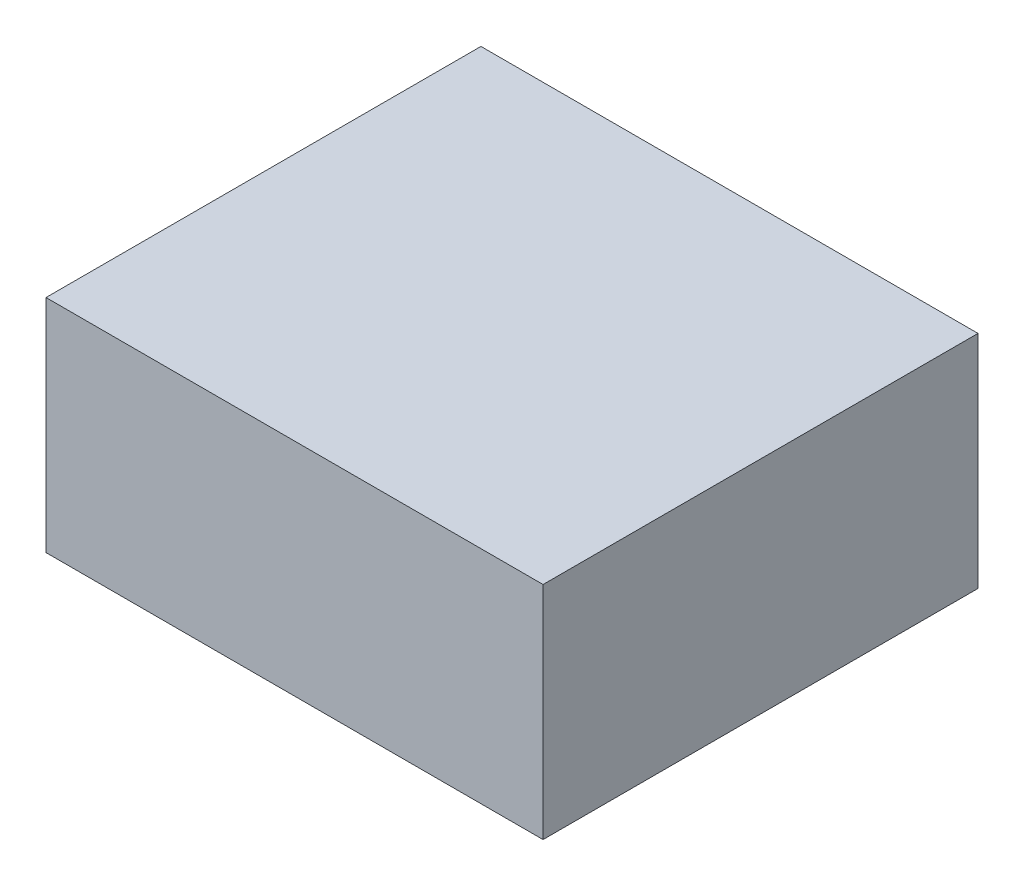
from build123d import *

# Parameters (mm, degrees)
SKETCH_1_W                 = 36
SKETCH_1_H                 = 16
ROTOR_TO_PALM_BRIDGE_DEPTH = 15.75


with BuildPart() as part:
    # Sketch 1 → Rotor_to_Palm_Bridge (new, symmetric)
    with BuildSketch(Plane.XY):
        with Locations((0, -53)):
            Rectangle(SKETCH_1_W, SKETCH_1_H)
    extrude(amount=ROTOR_TO_PALM_BRIDGE_DEPTH, both=True)


solid = part.part
